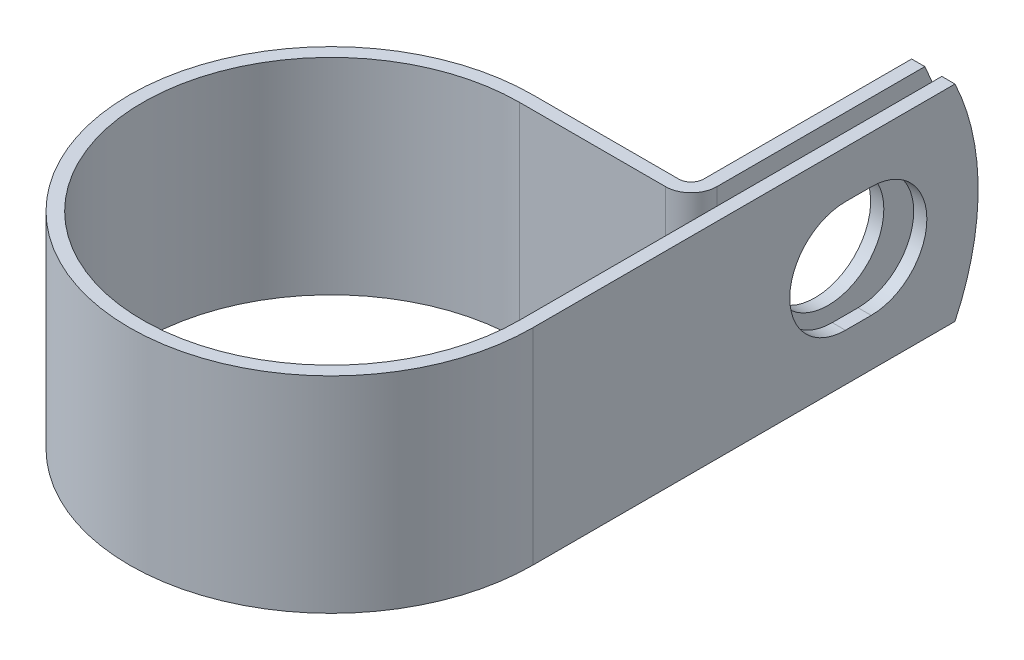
ISO-10303-21;
HEADER;
FILE_DESCRIPTION(('STEP AP214'),'2;1');
FILE_NAME('part.step','',(''),(''),'','','');
FILE_SCHEMA(('AUTOMOTIVE_DESIGN { 1 0 10303 214 1 1 1 1 }'));
ENDSEC;
DATA;
#1=APPLICATION_CONTEXT('core data for automotive mechanical design processes');
#2=APPLICATION_PROTOCOL_DEFINITION('international standard','automotive_design',2000,#1);
#3=PRODUCT_CONTEXT('',#1,'mechanical');
#4=PRODUCT('Part','Part','',(#3));
#5=PRODUCT_RELATED_PRODUCT_CATEGORY('part','',(#4));
#6=PRODUCT_DEFINITION_FORMATION('','',#4);
#7=PRODUCT_DEFINITION_CONTEXT('part definition',#1,'design');
#8=PRODUCT_DEFINITION('design','',#6,#7);
#9=PRODUCT_DEFINITION_SHAPE('','',#8);
#10=(LENGTH_UNIT() NAMED_UNIT(*) SI_UNIT(.MILLI.,.METRE.));
#11=(NAMED_UNIT(*) PLANE_ANGLE_UNIT() SI_UNIT($,.RADIAN.));
#12=(NAMED_UNIT(*) SI_UNIT($,.STERADIAN.) SOLID_ANGLE_UNIT());
#13=UNCERTAINTY_MEASURE_WITH_UNIT(LENGTH_MEASURE(1.E-05),#10,'distance_accuracy_value','');
#14=(GEOMETRIC_REPRESENTATION_CONTEXT(3) GLOBAL_UNCERTAINTY_ASSIGNED_CONTEXT((#13)) GLOBAL_UNIT_ASSIGNED_CONTEXT((#10,
#11,#12)) REPRESENTATION_CONTEXT('',''));
#15=CARTESIAN_POINT('',(0.,0.,0.));
#16=DIRECTION('',(0.,0.,1.));
#17=DIRECTION('',(1.,0.,0.));
#18=AXIS2_PLACEMENT_3D('',#15,#16,#17);
#19=CARTESIAN_POINT('',(17.4625,9.525,0.));
#20=DIRECTION('',(-1.,0.,0.));
#21=DIRECTION('',(0.,0.,1.));
#22=AXIS2_PLACEMENT_3D('',#19,#20,#21);
#23=PLANE('',#22);
#24=DIRECTION('',(0.,0.,-1.));
#25=VECTOR('',#24,1.);
#26=CARTESIAN_POINT('',(17.4625,-5.1562,-28.9559999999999));
#27=LINE('',#26,#25);
#28=CARTESIAN_POINT('',(17.4625,-5.1562,-28.9559999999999));
#29=VERTEX_POINT('',#28);
#30=CARTESIAN_POINT('',(17.4625,-5.1562,-31.3436000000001));
#31=VERTEX_POINT('',#30);
#32=EDGE_CURVE('E236',#29,#31,#27,.T.);
#33=ORIENTED_EDGE('',*,*,#32,.T.);
#34=CARTESIAN_POINT('',(17.4625,0.,-31.3435999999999));
#35=DIRECTION('',(-1.,0.,0.));
#36=DIRECTION('',(0.,0.,1.));
#37=AXIS2_PLACEMENT_3D('',#34,#35,#36);
#38=CIRCLE('',#37,5.1562);
#39=CARTESIAN_POINT('',(17.4625,5.1562,-31.3436000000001));
#40=VERTEX_POINT('',#39);
#41=EDGE_CURVE('E257',#31,#40,#38,.F.);
#42=ORIENTED_EDGE('',*,*,#41,.T.);
#43=DIRECTION('',(0.,0.,1.));
#44=VECTOR('',#43,1.);
#45=CARTESIAN_POINT('',(17.4625,5.1562,-28.9559999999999));
#46=LINE('',#45,#44);
#47=CARTESIAN_POINT('',(17.4625,5.1562,-28.9559999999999));
#48=VERTEX_POINT('',#47);
#49=EDGE_CURVE('E253',#40,#48,#46,.T.);
#50=ORIENTED_EDGE('',*,*,#49,.T.);
#51=CARTESIAN_POINT('',(17.4625,0.,-28.9559999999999));
#52=DIRECTION('',(-1.,0.,0.));
#53=DIRECTION('',(0.,0.,1.));
#54=AXIS2_PLACEMENT_3D('',#51,#52,#53);
#55=CIRCLE('',#54,5.1562);
#56=EDGE_CURVE('E248',#48,#29,#55,.F.);
#57=ORIENTED_EDGE('',*,*,#56,.T.);
#58=EDGE_LOOP('',(#33,#42,#50,#57));
#59=FACE_BOUND('',#58,.T.);
#60=CARTESIAN_POINT('',(17.4625,0.,-19.0246));
#61=DIRECTION('',(-1.,0.,0.));
#62=DIRECTION('',(0.,0.,1.));
#63=AXIS2_PLACEMENT_3D('',#60,#61,#62);
#64=CIRCLE('',#63,22.225);
#65=CARTESIAN_POINT('',(17.4625,9.525,-39.1050631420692));
#66=VERTEX_POINT('',#65);
#67=CARTESIAN_POINT('',(17.4625,-9.525,-39.1050631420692));
#68=VERTEX_POINT('',#67);
#69=EDGE_CURVE('E75',#66,#68,#64,.T.);
#70=ORIENTED_EDGE('',*,*,#69,.T.);
#71=DIRECTION('',(0.,0.,-1.));
#72=VECTOR('',#71,1.);
#73=CARTESIAN_POINT('',(17.4625,-9.525,0.));
#74=LINE('',#73,#72);
#75=CARTESIAN_POINT('',(17.4625,-9.525,0.));
#76=VERTEX_POINT('',#75);
#77=EDGE_CURVE('E271',#76,#68,#74,.T.);
#78=ORIENTED_EDGE('',*,*,#77,.F.);
#79=DIRECTION('',(0.,-1.,0.));
#80=VECTOR('',#79,1.);
#81=CARTESIAN_POINT('',(17.4625,9.525,0.));
#82=LINE('',#81,#80);
#83=CARTESIAN_POINT('',(17.4625,9.525,0.));
#84=VERTEX_POINT('',#83);
#85=EDGE_CURVE('E218',#84,#76,#82,.T.);
#86=ORIENTED_EDGE('',*,*,#85,.F.);
#87=DIRECTION('',(0.,0.,-1.));
#88=VECTOR('',#87,1.);
#89=CARTESIAN_POINT('',(17.4625,9.525,-17.4625));
#90=LINE('',#89,#88);
#91=EDGE_CURVE('E273',#84,#66,#90,.T.);
#92=ORIENTED_EDGE('',*,*,#91,.T.);
#93=EDGE_LOOP('',(#70,#78,#86,#92));
#94=FACE_BOUND('',#93,.T.);
#95=ADVANCED_FACE('F54',(#59,#94),#23,.T.);
#96=CARTESIAN_POINT('',(15.8877,9.525,-41.2496));
#97=DIRECTION('',(1.,0.,0.));
#98=DIRECTION('',(0.,0.,-1.));
#99=AXIS2_PLACEMENT_3D('',#96,#97,#98);
#100=PLANE('',#99);
#101=CARTESIAN_POINT('',(15.8877,0.,-30.1498));
#102=DIRECTION('',(1.,0.,0.));
#103=DIRECTION('',(0.,0.,-1.));
#104=AXIS2_PLACEMENT_3D('',#101,#102,#103);
#105=CIRCLE('',#104,5.1562);
#106=CARTESIAN_POINT('',(15.8877,0.,-35.306));
#107=VERTEX_POINT('',#106);
#108=EDGE_CURVE('E268',#107,#107,#105,.F.);
#109=ORIENTED_EDGE('',*,*,#108,.T.);
#110=EDGE_LOOP('',(#109));
#111=FACE_BOUND('',#110,.T.);
#112=DIRECTION('',(0.,0.,1.));
#113=VECTOR('',#112,1.);
#114=CARTESIAN_POINT('',(15.8877,-9.525,-41.2496));
#115=LINE('',#114,#113);
#116=CARTESIAN_POINT('',(15.8877,-9.525,-39.1050631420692));
#117=VERTEX_POINT('',#116);
#118=CARTESIAN_POINT('',(15.8877,-9.525,-19.83994));
#119=VERTEX_POINT('',#118);
#120=EDGE_CURVE('E184',#117,#119,#115,.T.);
#121=ORIENTED_EDGE('',*,*,#120,.F.);
#122=CARTESIAN_POINT('',(15.8877,0.,-19.0246));
#123=DIRECTION('',(1.,0.,0.));
#124=DIRECTION('',(0.,0.,-1.));
#125=AXIS2_PLACEMENT_3D('',#122,#123,#124);
#126=CIRCLE('',#125,22.225);
#127=CARTESIAN_POINT('',(15.8877,9.525,-39.1050631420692));
#128=VERTEX_POINT('',#127);
#129=EDGE_CURVE('E176',#117,#128,#126,.T.);
#130=ORIENTED_EDGE('',*,*,#129,.T.);
#131=DIRECTION('',(0.,0.,1.));
#132=VECTOR('',#131,1.);
#133=CARTESIAN_POINT('',(15.8877,9.525,-41.2496));
#134=LINE('',#133,#132);
#135=CARTESIAN_POINT('',(15.8877,9.525,-19.83994));
#136=VERTEX_POINT('',#135);
#137=EDGE_CURVE('E224',#128,#136,#134,.T.);
#138=ORIENTED_EDGE('',*,*,#137,.T.);
#139=DIRECTION('',(0.,-1.,0.));
#140=VECTOR('',#139,1.);
#141=CARTESIAN_POINT('',(15.8877,9.525,-19.83994));
#142=LINE('',#141,#140);
#143=EDGE_CURVE('E211',#136,#119,#142,.T.);
#144=ORIENTED_EDGE('',*,*,#143,.T.);
#145=EDGE_LOOP('',(#121,#130,#138,#144));
#146=FACE_BOUND('',#145,.T.);
#147=ADVANCED_FACE('F226',(#111,#146),#100,.T.);
#148=CARTESIAN_POINT('',(14.6685,9.525,-41.2496));
#149=DIRECTION('',(1.,0.,0.));
#150=DIRECTION('',(0.,0.,-1.));
#151=AXIS2_PLACEMENT_3D('',#148,#149,#150);
#152=PLANE('',#151);
#153=CARTESIAN_POINT('',(14.6685,0.,-30.1498));
#154=DIRECTION('',(-1.,0.,0.));
#155=DIRECTION('',(0.,0.,1.));
#156=AXIS2_PLACEMENT_3D('',#153,#154,#155);
#157=CIRCLE('',#156,5.1562);
#158=CARTESIAN_POINT('',(14.6685,0.,-24.9936));
#159=VERTEX_POINT('',#158);
#160=EDGE_CURVE('E265',#159,#159,#157,.T.);
#161=ORIENTED_EDGE('',*,*,#160,.F.);
#162=EDGE_LOOP('',(#161));
#163=FACE_BOUND('',#162,.T.);
#164=CARTESIAN_POINT('',(14.6685,0.,-19.0246));
#165=DIRECTION('',(-1.,0.,0.));
#166=DIRECTION('',(0.,0.,1.));
#167=AXIS2_PLACEMENT_3D('',#164,#165,#166);
#168=CIRCLE('',#167,22.225);
#169=CARTESIAN_POINT('',(14.6685,9.525,-39.1050631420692));
#170=VERTEX_POINT('',#169);
#171=CARTESIAN_POINT('',(14.6685,-9.525,-39.1050631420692));
#172=VERTEX_POINT('',#171);
#173=EDGE_CURVE('E67',#170,#172,#168,.T.);
#174=ORIENTED_EDGE('',*,*,#173,.T.);
#175=DIRECTION('',(0.,0.,-1.));
#176=VECTOR('',#175,1.);
#177=CARTESIAN_POINT('',(14.6685,-9.525,-41.2496));
#178=LINE('',#177,#176);
#179=CARTESIAN_POINT('',(14.6685,-9.525,-19.83994));
#180=VERTEX_POINT('',#179);
#181=EDGE_CURVE('E167',#172,#180,#178,.F.);
#182=ORIENTED_EDGE('',*,*,#181,.T.);
#183=DIRECTION('',(0.,-1.,0.));
#184=VECTOR('',#183,1.);
#185=CARTESIAN_POINT('',(14.6685,9.525,-19.83994));
#186=LINE('',#185,#184);
#187=CARTESIAN_POINT('',(14.6685,9.525,-19.83994));
#188=VERTEX_POINT('',#187);
#189=EDGE_CURVE('E209',#188,#180,#186,.T.);
#190=ORIENTED_EDGE('',*,*,#189,.F.);
#191=DIRECTION('',(0.,0.,-1.));
#192=VECTOR('',#191,1.);
#193=CARTESIAN_POINT('',(14.6685,9.525,-41.2496));
#194=LINE('',#193,#192);
#195=EDGE_CURVE('E169',#170,#188,#194,.F.);
#196=ORIENTED_EDGE('',*,*,#195,.F.);
#197=EDGE_LOOP('',(#174,#182,#190,#196));
#198=FACE_BOUND('',#197,.T.);
#199=ADVANCED_FACE('F164',(#163,#198),#152,.F.);
#200=CARTESIAN_POINT('',(18.6817,9.525,0.));
#201=DIRECTION('',(-1.,0.,0.));
#202=DIRECTION('',(0.,0.,1.));
#203=AXIS2_PLACEMENT_3D('',#200,#201,#202);
#204=PLANE('',#203);
#205=CARTESIAN_POINT('',(18.6817,0.,-31.3435999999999));
#206=DIRECTION('',(1.,0.,0.));
#207=DIRECTION('',(0.,0.,-1.));
#208=AXIS2_PLACEMENT_3D('',#205,#206,#207);
#209=CIRCLE('',#208,5.1562);
#210=CARTESIAN_POINT('',(18.6817,-5.1562,-31.3436000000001));
#211=VERTEX_POINT('',#210);
#212=CARTESIAN_POINT('',(18.6817,5.1562,-31.3436000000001));
#213=VERTEX_POINT('',#212);
#214=EDGE_CURVE('E237',#211,#213,#209,.T.);
#215=ORIENTED_EDGE('',*,*,#214,.F.);
#216=DIRECTION('',(0.,0.,-1.));
#217=VECTOR('',#216,1.);
#218=CARTESIAN_POINT('',(18.6817,-5.1562,-28.9559999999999));
#219=LINE('',#218,#217);
#220=CARTESIAN_POINT('',(18.6817,-5.1562,-28.9559999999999));
#221=VERTEX_POINT('',#220);
#222=EDGE_CURVE('E240',#221,#211,#219,.T.);
#223=ORIENTED_EDGE('',*,*,#222,.F.);
#224=CARTESIAN_POINT('',(18.6817,0.,-28.9559999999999));
#225=DIRECTION('',(1.,0.,0.));
#226=DIRECTION('',(0.,0.,-1.));
#227=AXIS2_PLACEMENT_3D('',#224,#225,#226);
#228=CIRCLE('',#227,5.1562);
#229=CARTESIAN_POINT('',(18.6817,5.1562,-28.9559999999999));
#230=VERTEX_POINT('',#229);
#231=EDGE_CURVE('E230',#230,#221,#228,.T.);
#232=ORIENTED_EDGE('',*,*,#231,.F.);
#233=DIRECTION('',(0.,0.,1.));
#234=VECTOR('',#233,1.);
#235=CARTESIAN_POINT('',(18.6817,5.1562,-28.9559999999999));
#236=LINE('',#235,#234);
#237=EDGE_CURVE('E234',#213,#230,#236,.T.);
#238=ORIENTED_EDGE('',*,*,#237,.F.);
#239=EDGE_LOOP('',(#215,#223,#232,#238));
#240=FACE_BOUND('',#239,.T.);
#241=DIRECTION('',(0.,0.,-1.));
#242=VECTOR('',#241,1.);
#243=CARTESIAN_POINT('',(18.6817,-9.525,0.));
#244=LINE('',#243,#242);
#245=CARTESIAN_POINT('',(18.6817,-9.525,0.));
#246=VERTEX_POINT('',#245);
#247=CARTESIAN_POINT('',(18.6817,-9.525,-39.1050631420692));
#248=VERTEX_POINT('',#247);
#249=EDGE_CURVE('E195',#246,#248,#244,.T.);
#250=ORIENTED_EDGE('',*,*,#249,.T.);
#251=CARTESIAN_POINT('',(18.6817,0.,-19.0246));
#252=DIRECTION('',(-1.,0.,0.));
#253=DIRECTION('',(0.,0.,1.));
#254=AXIS2_PLACEMENT_3D('',#251,#252,#253);
#255=CIRCLE('',#254,22.225);
#256=CARTESIAN_POINT('',(18.6817,9.525,-39.1050631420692));
#257=VERTEX_POINT('',#256);
#258=EDGE_CURVE('E170',#257,#248,#255,.T.);
#259=ORIENTED_EDGE('',*,*,#258,.F.);
#260=DIRECTION('',(0.,0.,-1.));
#261=VECTOR('',#260,1.);
#262=CARTESIAN_POINT('',(18.6817,9.525,-17.4625));
#263=LINE('',#262,#261);
#264=CARTESIAN_POINT('',(18.6817,9.525,0.));
#265=VERTEX_POINT('',#264);
#266=EDGE_CURVE('E198',#265,#257,#263,.T.);
#267=ORIENTED_EDGE('',*,*,#266,.F.);
#268=DIRECTION('',(0.,-1.,0.));
#269=VECTOR('',#268,1.);
#270=CARTESIAN_POINT('',(18.6817,9.525,0.));
#271=LINE('',#270,#269);
#272=EDGE_CURVE('E199',#265,#246,#271,.T.);
#273=ORIENTED_EDGE('',*,*,#272,.T.);
#274=EDGE_LOOP('',(#250,#259,#267,#273));
#275=FACE_BOUND('',#274,.T.);
#276=ADVANCED_FACE('F321',(#240,#275),#204,.F.);
#277=CARTESIAN_POINT('',(0.,-9.525,0.));
#278=DIRECTION('',(0.,1.,0.));
#279=DIRECTION('',(1.,0.,0.));
#280=AXIS2_PLACEMENT_3D('',#277,#278,#279);
#281=PLANE('',#280);
#282=DIRECTION('',(-1.,0.,0.));
#283=VECTOR('',#282,1.);
#284=CARTESIAN_POINT('',(18.6817,-9.525,-39.1050631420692));
#285=LINE('',#284,#283);
#286=EDGE_CURVE('E171',#248,#68,#285,.T.);
#287=ORIENTED_EDGE('',*,*,#286,.F.);
#288=ORIENTED_EDGE('',*,*,#249,.F.);
#289=CARTESIAN_POINT('',(0.,-9.525,0.));
#290=DIRECTION('',(0.,1.,0.));
#291=DIRECTION('',(1.,0.,0.));
#292=AXIS2_PLACEMENT_3D('',#289,#290,#291);
#293=CIRCLE('',#292,18.6817);
#294=CARTESIAN_POINT('',(0.,-9.525,-18.6817));
#295=VERTEX_POINT('',#294);
#296=EDGE_CURVE('E193',#295,#246,#293,.T.);
#297=ORIENTED_EDGE('',*,*,#296,.F.);
#298=DIRECTION('',(1.,0.,0.));
#299=VECTOR('',#298,1.);
#300=CARTESIAN_POINT('',(0.,-9.525,-18.6817));
#301=LINE('',#300,#299);
#302=CARTESIAN_POINT('',(13.51026,-9.525,-18.6817));
#303=VERTEX_POINT('',#302);
#304=EDGE_CURVE('E186',#303,#295,#301,.F.);
#305=ORIENTED_EDGE('',*,*,#304,.F.);
#306=CARTESIAN_POINT('',(13.51026,-9.525,-19.83994));
#307=DIRECTION('',(0.,1.,0.));
#308=DIRECTION('',(1.,0.,0.));
#309=AXIS2_PLACEMENT_3D('',#306,#307,#308);
#310=CIRCLE('',#309,1.15824);
#311=EDGE_CURVE('E183',#180,#303,#310,.F.);
#312=ORIENTED_EDGE('',*,*,#311,.F.);
#313=ORIENTED_EDGE('',*,*,#181,.F.);
#314=DIRECTION('',(-1.,0.,0.));
#315=VECTOR('',#314,1.);
#316=CARTESIAN_POINT('',(18.6817,-9.525,-39.1050631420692));
#317=LINE('',#316,#315);
#318=EDGE_CURVE('E12',#117,#172,#317,.T.);
#319=ORIENTED_EDGE('',*,*,#318,.F.);
#320=ORIENTED_EDGE('',*,*,#120,.T.);
#321=CARTESIAN_POINT('',(13.51026,-9.525,-19.83994));
#322=DIRECTION('',(0.,-1.,0.));
#323=DIRECTION('',(0.,0.,1.));
#324=AXIS2_PLACEMENT_3D('',#321,#322,#323);
#325=CIRCLE('',#324,2.37744);
#326=CARTESIAN_POINT('',(13.51026,-9.525,-17.4625));
#327=VERTEX_POINT('',#326);
#328=EDGE_CURVE('E188',#119,#327,#325,.T.);
#329=ORIENTED_EDGE('',*,*,#328,.T.);
#330=DIRECTION('',(-1.,0.,0.));
#331=VECTOR('',#330,1.);
#332=CARTESIAN_POINT('',(0.,-9.525,-17.4625));
#333=LINE('',#332,#331);
#334=CARTESIAN_POINT('',(0.,-9.525,-17.4625));
#335=VERTEX_POINT('',#334);
#336=EDGE_CURVE('E298',#327,#335,#333,.T.);
#337=ORIENTED_EDGE('',*,*,#336,.T.);
#338=CARTESIAN_POINT('',(0.,-9.525,0.));
#339=DIRECTION('',(0.,1.,0.));
#340=DIRECTION('',(0.,0.,1.));
#341=AXIS2_PLACEMENT_3D('',#338,#339,#340);
#342=CIRCLE('',#341,17.4625);
#343=EDGE_CURVE('E295',#335,#76,#342,.T.);
#344=ORIENTED_EDGE('',*,*,#343,.T.);
#345=ORIENTED_EDGE('',*,*,#77,.T.);
#346=EDGE_LOOP('',(#287,#288,#297,#305,#312,#313,#319,#320,#329,#337,#344,#345));
#347=FACE_BOUND('',#346,.T.);
#348=ADVANCED_FACE('F181',(#347),#281,.F.);
#349=CARTESIAN_POINT('',(0.,9.525,0.));
#350=DIRECTION('',(0.,1.,0.));
#351=DIRECTION('',(1.,0.,0.));
#352=AXIS2_PLACEMENT_3D('',#349,#350,#351);
#353=PLANE('',#352);
#354=ORIENTED_EDGE('',*,*,#266,.T.);
#355=DIRECTION('',(-1.,0.,0.));
#356=VECTOR('',#355,1.);
#357=CARTESIAN_POINT('',(18.6817,9.525,-39.1050631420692));
#358=LINE('',#357,#356);
#359=EDGE_CURVE('E228',#257,#66,#358,.T.);
#360=ORIENTED_EDGE('',*,*,#359,.T.);
#361=ORIENTED_EDGE('',*,*,#91,.F.);
#362=CARTESIAN_POINT('',(0.,9.525,0.));
#363=DIRECTION('',(0.,1.,0.));
#364=DIRECTION('',(0.,0.,1.));
#365=AXIS2_PLACEMENT_3D('',#362,#363,#364);
#366=CIRCLE('',#365,17.4625);
#367=CARTESIAN_POINT('',(0.,9.525,-17.4625));
#368=VERTEX_POINT('',#367);
#369=EDGE_CURVE('E276',#368,#84,#366,.T.);
#370=ORIENTED_EDGE('',*,*,#369,.F.);
#371=DIRECTION('',(-1.,0.,0.));
#372=VECTOR('',#371,1.);
#373=CARTESIAN_POINT('',(0.,9.525,-17.4625));
#374=LINE('',#373,#372);
#375=CARTESIAN_POINT('',(13.51026,9.525,-17.4625));
#376=VERTEX_POINT('',#375);
#377=EDGE_CURVE('E279',#376,#368,#374,.T.);
#378=ORIENTED_EDGE('',*,*,#377,.F.);
#379=CARTESIAN_POINT('',(13.51026,9.525,-19.83994));
#380=DIRECTION('',(0.,-1.,0.));
#381=DIRECTION('',(0.,0.,1.));
#382=AXIS2_PLACEMENT_3D('',#379,#380,#381);
#383=CIRCLE('',#382,2.37744);
#384=EDGE_CURVE('E282',#136,#376,#383,.T.);
#385=ORIENTED_EDGE('',*,*,#384,.F.);
#386=ORIENTED_EDGE('',*,*,#137,.F.);
#387=DIRECTION('',(-1.,0.,0.));
#388=VECTOR('',#387,1.);
#389=CARTESIAN_POINT('',(18.6817,9.525,-39.1050631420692));
#390=LINE('',#389,#388);
#391=EDGE_CURVE('E61',#128,#170,#390,.T.);
#392=ORIENTED_EDGE('',*,*,#391,.T.);
#393=ORIENTED_EDGE('',*,*,#195,.T.);
#394=CARTESIAN_POINT('',(13.51026,9.525,-19.83994));
#395=DIRECTION('',(0.,1.,0.));
#396=DIRECTION('',(1.,0.,0.));
#397=AXIS2_PLACEMENT_3D('',#394,#395,#396);
#398=CIRCLE('',#397,1.15824);
#399=CARTESIAN_POINT('',(13.51026,9.525,-18.6817));
#400=VERTEX_POINT('',#399);
#401=EDGE_CURVE('E287',#188,#400,#398,.F.);
#402=ORIENTED_EDGE('',*,*,#401,.T.);
#403=DIRECTION('',(1.,0.,0.));
#404=VECTOR('',#403,1.);
#405=CARTESIAN_POINT('',(0.,9.525,-18.6817));
#406=LINE('',#405,#404);
#407=CARTESIAN_POINT('',(0.,9.525,-18.6817));
#408=VERTEX_POINT('',#407);
#409=EDGE_CURVE('E289',#400,#408,#406,.F.);
#410=ORIENTED_EDGE('',*,*,#409,.T.);
#411=CARTESIAN_POINT('',(0.,9.525,0.));
#412=DIRECTION('',(0.,1.,0.));
#413=DIRECTION('',(1.,0.,0.));
#414=AXIS2_PLACEMENT_3D('',#411,#412,#413);
#415=CIRCLE('',#414,18.6817);
#416=EDGE_CURVE('E203',#408,#265,#415,.T.);
#417=ORIENTED_EDGE('',*,*,#416,.T.);
#418=EDGE_LOOP('',(#354,#360,#361,#370,#378,#385,#386,#392,#393,#402,#410,#417));
#419=FACE_BOUND('',#418,.T.);
#420=ADVANCED_FACE('F222',(#419),#353,.T.);
#421=CARTESIAN_POINT('',(0.,9.525,0.));
#422=DIRECTION('',(0.,-1.,0.));
#423=DIRECTION('',(0.,0.,-1.));
#424=AXIS2_PLACEMENT_3D('',#421,#422,#423);
#425=CYLINDRICAL_SURFACE('',#424,17.4625);
#426=ORIENTED_EDGE('',*,*,#343,.F.);
#427=DIRECTION('',(0.,-1.,0.));
#428=VECTOR('',#427,1.);
#429=CARTESIAN_POINT('',(0.,9.525,-17.4625));
#430=LINE('',#429,#428);
#431=EDGE_CURVE('E216',#368,#335,#430,.T.);
#432=ORIENTED_EDGE('',*,*,#431,.F.);
#433=ORIENTED_EDGE('',*,*,#369,.T.);
#434=ORIENTED_EDGE('',*,*,#85,.T.);
#435=EDGE_LOOP('',(#426,#432,#433,#434));
#436=FACE_BOUND('',#435,.T.);
#437=ADVANCED_FACE('F311',(#436),#425,.F.);
#438=CARTESIAN_POINT('',(0.,9.525,-17.4625));
#439=DIRECTION('',(0.,0.,1.));
#440=DIRECTION('',(1.,0.,0.));
#441=AXIS2_PLACEMENT_3D('',#438,#439,#440);
#442=PLANE('',#441);
#443=ORIENTED_EDGE('',*,*,#336,.F.);
#444=DIRECTION('',(0.,-1.,0.));
#445=VECTOR('',#444,1.);
#446=CARTESIAN_POINT('',(13.51026,9.525,-17.4625));
#447=LINE('',#446,#445);
#448=EDGE_CURVE('E214',#376,#327,#447,.T.);
#449=ORIENTED_EDGE('',*,*,#448,.F.);
#450=ORIENTED_EDGE('',*,*,#377,.T.);
#451=ORIENTED_EDGE('',*,*,#431,.T.);
#452=EDGE_LOOP('',(#443,#449,#450,#451));
#453=FACE_BOUND('',#452,.T.);
#454=ADVANCED_FACE('F307',(#453),#442,.T.);
#455=CARTESIAN_POINT('',(13.51026,9.525,-19.83994));
#456=DIRECTION('',(0.,-1.,0.));
#457=DIRECTION('',(0.,0.,-1.));
#458=AXIS2_PLACEMENT_3D('',#455,#456,#457);
#459=CYLINDRICAL_SURFACE('',#458,2.37744);
#460=ORIENTED_EDGE('',*,*,#328,.F.);
#461=ORIENTED_EDGE('',*,*,#143,.F.);
#462=ORIENTED_EDGE('',*,*,#384,.T.);
#463=ORIENTED_EDGE('',*,*,#448,.T.);
#464=EDGE_LOOP('',(#460,#461,#462,#463));
#465=FACE_BOUND('',#464,.T.);
#466=ADVANCED_FACE('F304',(#465),#459,.T.);
#467=CARTESIAN_POINT('',(13.51026,9.525,-19.83994));
#468=DIRECTION('',(0.,-1.,0.));
#469=DIRECTION('',(0.,0.,-1.));
#470=AXIS2_PLACEMENT_3D('',#467,#468,#469);
#471=CYLINDRICAL_SURFACE('',#470,1.15824);
#472=ORIENTED_EDGE('',*,*,#311,.T.);
#473=DIRECTION('',(0.,-1.,0.));
#474=VECTOR('',#473,1.);
#475=CARTESIAN_POINT('',(13.51026,9.525,-18.6817));
#476=LINE('',#475,#474);
#477=EDGE_CURVE('E206',#400,#303,#476,.T.);
#478=ORIENTED_EDGE('',*,*,#477,.F.);
#479=ORIENTED_EDGE('',*,*,#401,.F.);
#480=ORIENTED_EDGE('',*,*,#189,.T.);
#481=EDGE_LOOP('',(#472,#478,#479,#480));
#482=FACE_BOUND('',#481,.T.);
#483=ADVANCED_FACE('F334',(#482),#471,.F.);
#484=CARTESIAN_POINT('',(0.,9.525,-18.6817));
#485=DIRECTION('',(0.,0.,1.));
#486=DIRECTION('',(1.,0.,0.));
#487=AXIS2_PLACEMENT_3D('',#484,#485,#486);
#488=PLANE('',#487);
#489=ORIENTED_EDGE('',*,*,#304,.T.);
#490=DIRECTION('',(0.,-1.,0.));
#491=VECTOR('',#490,1.);
#492=CARTESIAN_POINT('',(0.,9.525,-18.6817));
#493=LINE('',#492,#491);
#494=EDGE_CURVE('E202',#408,#295,#493,.T.);
#495=ORIENTED_EDGE('',*,*,#494,.F.);
#496=ORIENTED_EDGE('',*,*,#409,.F.);
#497=ORIENTED_EDGE('',*,*,#477,.T.);
#498=EDGE_LOOP('',(#489,#495,#496,#497));
#499=FACE_BOUND('',#498,.T.);
#500=ADVANCED_FACE('F330',(#499),#488,.F.);
#501=CARTESIAN_POINT('',(0.,9.525,0.));
#502=DIRECTION('',(0.,-1.,0.));
#503=DIRECTION('',(0.,0.,-1.));
#504=AXIS2_PLACEMENT_3D('',#501,#502,#503);
#505=CYLINDRICAL_SURFACE('',#504,18.6817);
#506=ORIENTED_EDGE('',*,*,#296,.T.);
#507=ORIENTED_EDGE('',*,*,#272,.F.);
#508=ORIENTED_EDGE('',*,*,#416,.F.);
#509=ORIENTED_EDGE('',*,*,#494,.T.);
#510=EDGE_LOOP('',(#506,#507,#508,#509));
#511=FACE_BOUND('',#510,.T.);
#512=ADVANCED_FACE('F327',(#511),#505,.T.);
#513=CARTESIAN_POINT('',(30.4716359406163,0.,-30.1498));
#514=DIRECTION('',(-1.,0.,0.));
#515=DIRECTION('',(0.,0.,1.));
#516=AXIS2_PLACEMENT_3D('',#513,#514,#515);
#517=CYLINDRICAL_SURFACE('',#516,5.1562);
#518=ORIENTED_EDGE('',*,*,#160,.T.);
#519=EDGE_LOOP('',(#518));
#520=FACE_BOUND('',#519,.T.);
#521=ORIENTED_EDGE('',*,*,#108,.F.);
#522=EDGE_LOOP('',(#521));
#523=FACE_BOUND('',#522,.T.);
#524=ADVANCED_FACE('F379',(#520,#523),#517,.F.);
#525=CARTESIAN_POINT('',(1.10292806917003,-5.1562,-28.9559999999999));
#526=DIRECTION('',(0.,-1.,0.));
#527=DIRECTION('',(0.,0.,-1.));
#528=AXIS2_PLACEMENT_3D('',#525,#526,#527);
#529=PLANE('',#528);
#530=DIRECTION('',(1.,0.,0.));
#531=VECTOR('',#530,1.);
#532=CARTESIAN_POINT('',(1.10292806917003,-5.1562,-28.9559999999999));
#533=LINE('',#532,#531);
#534=EDGE_CURVE('E251',#29,#221,#533,.T.);
#535=ORIENTED_EDGE('',*,*,#534,.T.);
#536=ORIENTED_EDGE('',*,*,#222,.T.);
#537=DIRECTION('',(1.,0.,0.));
#538=VECTOR('',#537,1.);
#539=CARTESIAN_POINT('',(1.10292806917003,-5.1562,-31.3436000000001));
#540=LINE('',#539,#538);
#541=EDGE_CURVE('E247',#31,#211,#540,.T.);
#542=ORIENTED_EDGE('',*,*,#541,.F.);
#543=ORIENTED_EDGE('',*,*,#32,.F.);
#544=EDGE_LOOP('',(#535,#536,#542,#543));
#545=FACE_BOUND('',#544,.T.);
#546=ADVANCED_FACE('F354',(#545),#529,.F.);
#547=CARTESIAN_POINT('',(1.10292806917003,0.,-31.3435999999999));
#548=DIRECTION('',(1.,0.,0.));
#549=DIRECTION('',(0.,0.,-1.));
#550=AXIS2_PLACEMENT_3D('',#547,#548,#549);
#551=CYLINDRICAL_SURFACE('',#550,5.1562);
#552=ORIENTED_EDGE('',*,*,#541,.T.);
#553=ORIENTED_EDGE('',*,*,#214,.T.);
#554=DIRECTION('',(1.,0.,0.));
#555=VECTOR('',#554,1.);
#556=CARTESIAN_POINT('',(1.10292806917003,5.1562,-31.3436000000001));
#557=LINE('',#556,#555);
#558=EDGE_CURVE('E256',#40,#213,#557,.T.);
#559=ORIENTED_EDGE('',*,*,#558,.F.);
#560=ORIENTED_EDGE('',*,*,#41,.F.);
#561=EDGE_LOOP('',(#552,#553,#559,#560));
#562=FACE_BOUND('',#561,.T.);
#563=ADVANCED_FACE('F358',(#562),#551,.F.);
#564=CARTESIAN_POINT('',(1.10292806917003,5.1562,-28.9559999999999));
#565=DIRECTION('',(0.,1.,0.));
#566=DIRECTION('',(0.,0.,1.));
#567=AXIS2_PLACEMENT_3D('',#564,#565,#566);
#568=PLANE('',#567);
#569=ORIENTED_EDGE('',*,*,#558,.T.);
#570=ORIENTED_EDGE('',*,*,#237,.T.);
#571=DIRECTION('',(1.,0.,0.));
#572=VECTOR('',#571,1.);
#573=CARTESIAN_POINT('',(1.10292806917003,5.1562,-28.9559999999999));
#574=LINE('',#573,#572);
#575=EDGE_CURVE('E252',#48,#230,#574,.T.);
#576=ORIENTED_EDGE('',*,*,#575,.F.);
#577=ORIENTED_EDGE('',*,*,#49,.F.);
#578=EDGE_LOOP('',(#569,#570,#576,#577));
#579=FACE_BOUND('',#578,.T.);
#580=ADVANCED_FACE('F362',(#579),#568,.F.);
#581=CARTESIAN_POINT('',(1.10292806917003,0.,-28.9559999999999));
#582=DIRECTION('',(1.,0.,0.));
#583=DIRECTION('',(0.,0.,-1.));
#584=AXIS2_PLACEMENT_3D('',#581,#582,#583);
#585=CYLINDRICAL_SURFACE('',#584,5.1562);
#586=ORIENTED_EDGE('',*,*,#575,.T.);
#587=ORIENTED_EDGE('',*,*,#231,.T.);
#588=ORIENTED_EDGE('',*,*,#534,.F.);
#589=ORIENTED_EDGE('',*,*,#56,.F.);
#590=EDGE_LOOP('',(#586,#587,#588,#589));
#591=FACE_BOUND('',#590,.T.);
#592=ADVANCED_FACE('F366',(#591),#585,.F.);
#593=CARTESIAN_POINT('',(18.6817,0.,-19.0246));
#594=DIRECTION('',(-1.,0.,0.));
#595=DIRECTION('',(0.,0.,1.));
#596=AXIS2_PLACEMENT_3D('',#593,#594,#595);
#597=CYLINDRICAL_SURFACE('',#596,22.225);
#598=ORIENTED_EDGE('',*,*,#129,.F.);
#599=ORIENTED_EDGE('',*,*,#318,.T.);
#600=ORIENTED_EDGE('',*,*,#173,.F.);
#601=ORIENTED_EDGE('',*,*,#391,.F.);
#602=EDGE_LOOP('',(#598,#599,#600,#601));
#603=FACE_BOUND('',#602,.T.);
#604=ADVANCED_FACE('F174',(#603),#597,.T.);
#605=ORIENTED_EDGE('',*,*,#359,.F.);
#606=ORIENTED_EDGE('',*,*,#258,.T.);
#607=ORIENTED_EDGE('',*,*,#286,.T.);
#608=ORIENTED_EDGE('',*,*,#69,.F.);
#609=EDGE_LOOP('',(#605,#606,#607,#608));
#610=FACE_BOUND('',#609,.T.);
#611=ADVANCED_FACE('F316',(#610),#597,.T.);
#612=CLOSED_SHELL('',(#95,#147,#199,#276,#348,#420,#437,#454,#466,#483,#500,#512,#524,#546,#563,
#580,#592,#604,#611));
#613=MANIFOLD_SOLID_BREP('B2',#612);
#614=ADVANCED_BREP_SHAPE_REPRESENTATION('',(#18,#613),#14);
#615=SHAPE_DEFINITION_REPRESENTATION(#9,#614);
ENDSEC;
END-ISO-10303-21;
